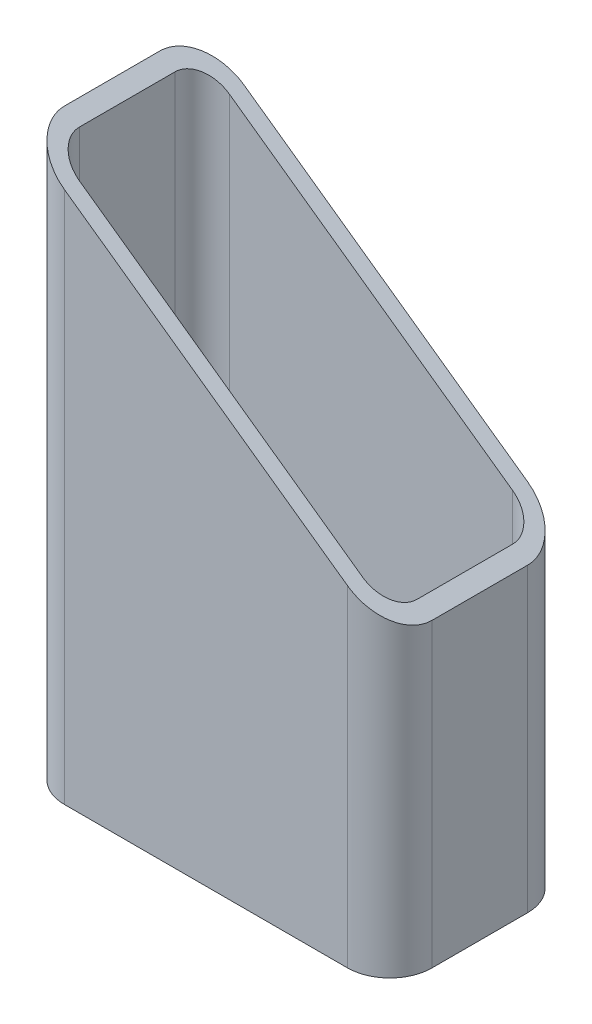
from build123d import *

# Parameters (mm, degrees)
SALIENTE_EXTRUIR1_DEPTH = 300
CORTAR_EXTRUIR1_DEPTH   = 300


with BuildPart() as part:
    # Croquis2 → Saliente-Extruir1 (new body)
    with BuildSketch(Plane(origin=(0, 0, 0), x_dir=(1, 0, 0), z_dir=(0, 1, 0))):
        with BuildLine():
            ThreePointArc((98, -25.5), (91.409902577, -41.409902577), (75.5, -48))
            Line((75.5, -48), (-75.5, -48))
            ThreePointArc((-75.5, -48), (-91.409902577, -41.409902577), (-98, -25.5))
            Line((-98, -25.5), (-98, 25.5))
            ThreePointArc((-98, 25.5), (-91.409902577, 41.409902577), (-75.5, 48))
            Line((-75.5, 48), (75.5, 48))
            ThreePointArc((75.5, 48), (91.409902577, 41.409902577), (98, 25.5))
            Line((98, 25.5), (98, -25.5))
        make_face()
        with BuildLine():
            Line((90, 25.5), (90, -25.5))
            ThreePointArc((90, -25.5), (85.753048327, -35.753048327), (75.5, -40))
            Line((75.5, -40), (-75.5, -40))
            ThreePointArc((-75.5, -40), (-85.753048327, -35.753048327), (-90, -25.5))
            Line((-90, -25.5), (-90, 25.5))
            ThreePointArc((-90, 25.5), (-85.753048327, 35.753048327), (-75.5, 40))
            Line((-75.5, 40), (75.5, 40))
            ThreePointArc((75.5, 40), (85.753048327, 35.753048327), (90, 25.5))
        make_face(mode=Mode.SUBTRACT)
    extrude(amount=SALIENTE_EXTRUIR1_DEPTH)

    # Croquis3 → Cortar-Extruir1 (cut)
    with BuildSketch(Plane.XY.offset(48)):
        Polygon((-98, 300), (98, 160.50330208), (98, 300), align=None)
    extrude(amount=-CORTAR_EXTRUIR1_DEPTH, mode=Mode.SUBTRACT)


solid = part.part
